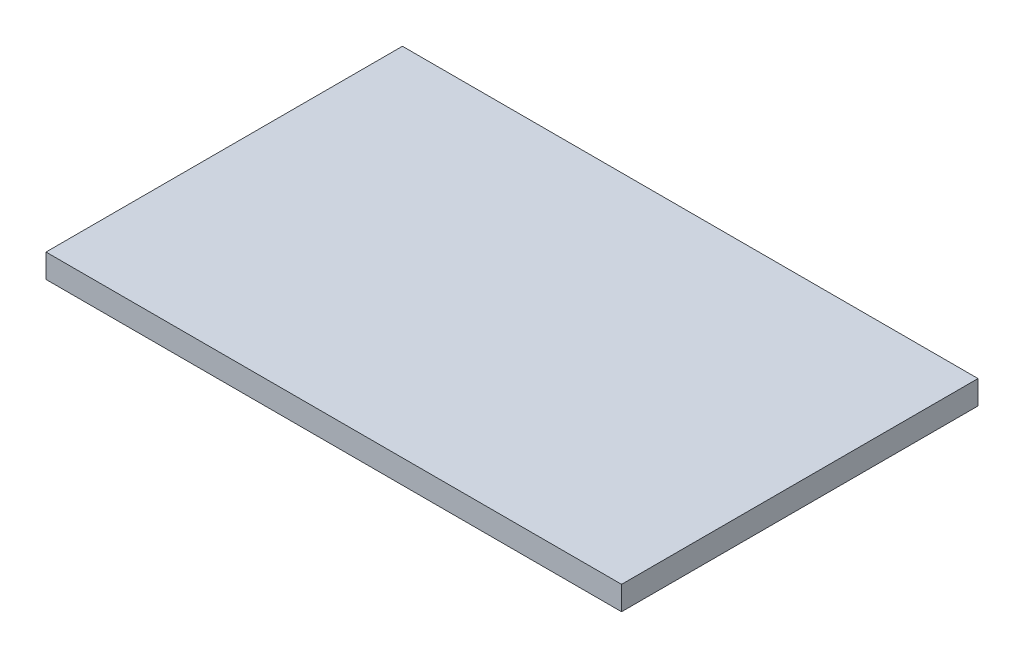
from build123d import *

# Parameters (mm, degrees)
SKETCH1_W      = 121.096569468
SKETCH1_H      = 74.990994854
EXTRUDE1_DEPTH = 5


with BuildPart() as part:
    # Sketch1 → Extrude1 (new body)
    with BuildSketch(Plane(origin=(0, 0, 0), x_dir=(1, 0, 0), z_dir=(0, 1, 0))):
        with Locations((60.548284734, 37.495497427)):
            Rectangle(SKETCH1_W, SKETCH1_H)
    extrude(amount=EXTRUDE1_DEPTH)


solid = part.part
